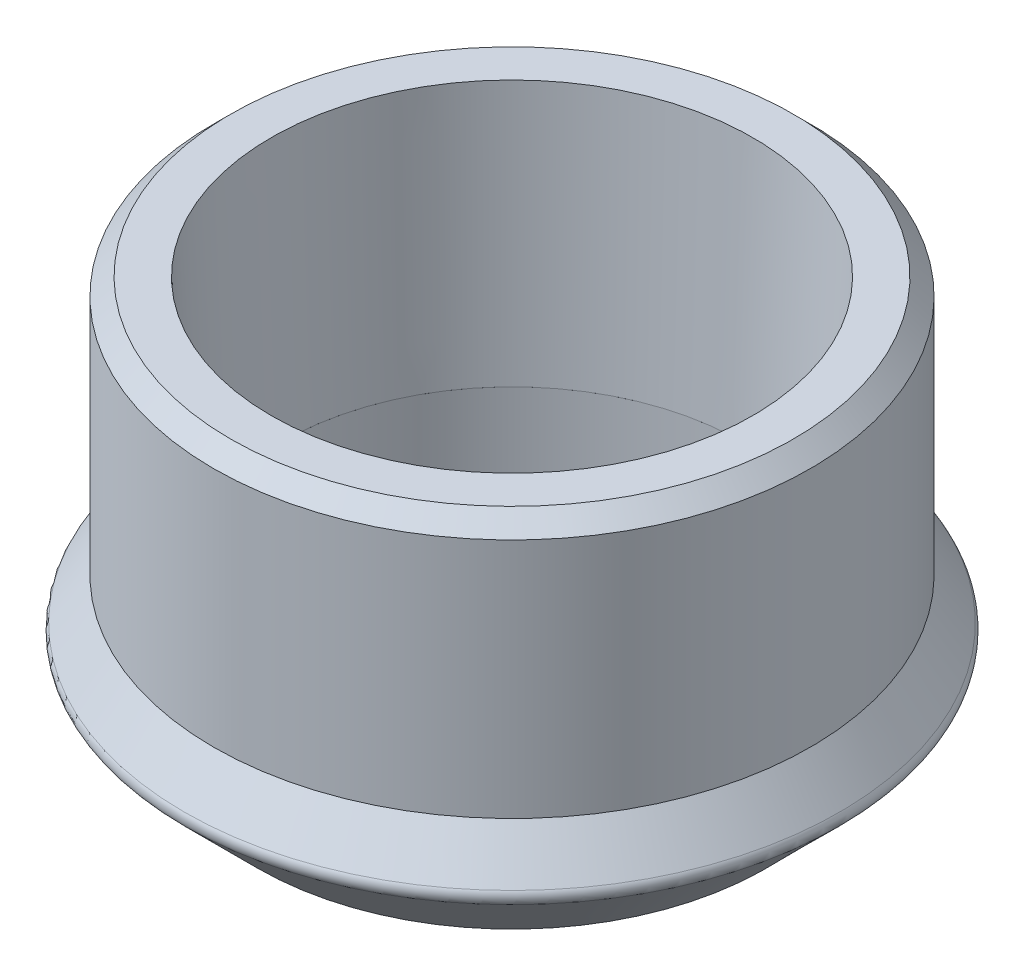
from build123d import *

# Parameters (mm, degrees)
SKETCH1_R           = 8.75
SKETCH1_R_2         = 6.75
BOSS_EXTRUDE1_DEPTH = 10
CHAMFER1_SIZE       = 0.31
CHAMFER1_SIZE2      = 7.585623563
CHAMFER3_SIZE       = 0.5
FILLET2_R           = 0.3


with BuildPart() as part:
    # Sketch1 → Boss-Extrude1 (new body)
    with BuildSketch(Plane(origin=(0, 0, 0), x_dir=(1, 0, 0), z_dir=(0, 1, 0))):
        with Locations(Location((0, 0, 0), (0, 0, 270))):
            Circle(SKETCH1_R)
        with Locations(Location((0, 0, 0), (0, 0, 270))):
            Circle(SKETCH1_R_2, mode=Mode.SUBTRACT)
    extrude(amount=BOSS_EXTRUDE1_DEPTH)

    # Chamfer1
    chamfer1_edges = [part.edges().sort_by_distance(p)[0] for p in [
        (0, 10, -6.75),
    ]]
    chamfer1_side = [part.faces().sort_by_distance(p)[0] for p in [
        (0, 10, -8.502512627),
    ]]
    chamfer(chamfer1_edges, length=CHAMFER1_SIZE, length2=CHAMFER1_SIZE2, reference=chamfer1_side[0])

    # Chamfer3
    chamfer3_edges = [part.edges().sort_by_distance(p)[0] for p in [
        (0, 10, -8.75),
    ]]
    chamfer(chamfer3_edges, length=CHAMFER3_SIZE)

    # Sketch2 → Revolve1 (revolve)
    with BuildSketch(Plane(origin=(0, 0, 0), x_dir=(0, 0, -1), z_dir=(1, 0, 0))):
        Polygon((-6.75, -1.3), (-6.75, 2.428148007), (-8.75, 2.428148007), (-9.75, 1), (-7.45, -1.3), align=None)
    revolve(axis=Axis((0, 10.565, 0), (0, -1, 0)))

    # Fillet2
    fillet2_edges = [part.edges().sort_by_distance(p)[0] for p in [
        (0, 1, -9.75),
    ]]
    fillet(fillet2_edges, radius=FILLET2_R)


solid = part.part
